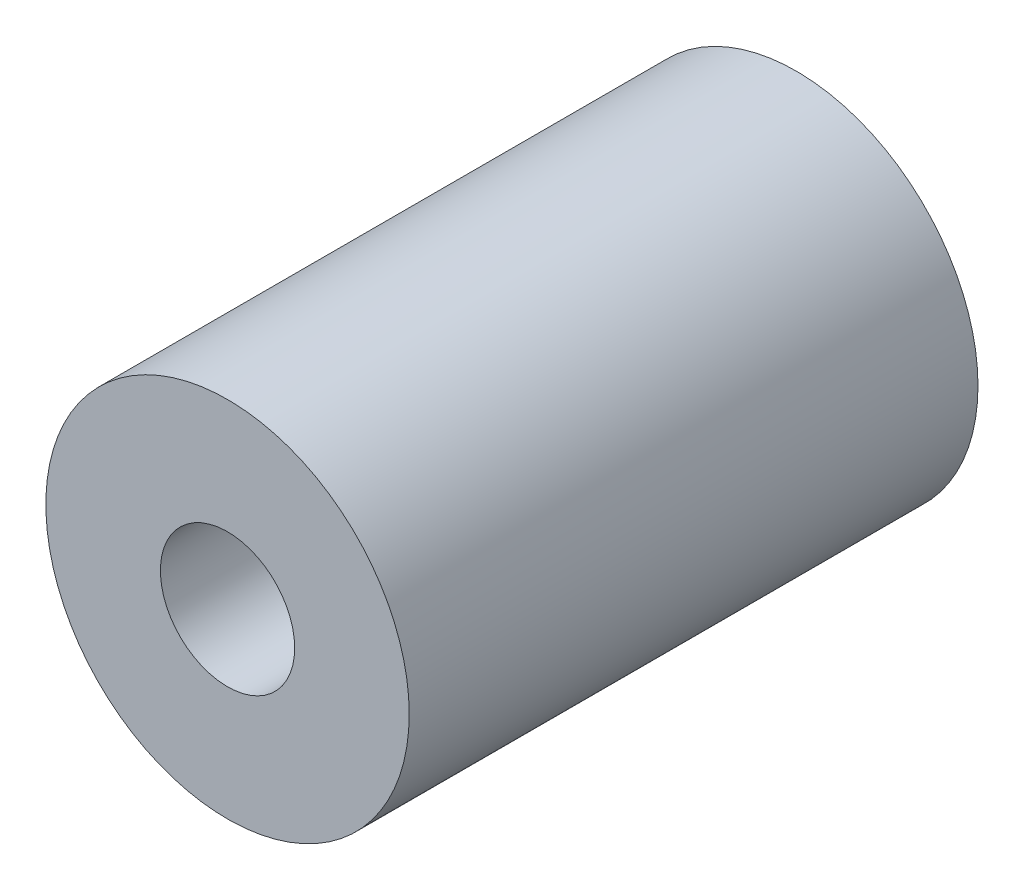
ISO-10303-21;
HEADER;
FILE_DESCRIPTION(('STEP AP214'),'2;1');
FILE_NAME('part.step','',(''),(''),'','','');
FILE_SCHEMA(('AUTOMOTIVE_DESIGN { 1 0 10303 214 1 1 1 1 }'));
ENDSEC;
DATA;
#1=APPLICATION_CONTEXT('core data for automotive mechanical design processes');
#2=APPLICATION_PROTOCOL_DEFINITION('international standard','automotive_design',2000,#1);
#3=PRODUCT_CONTEXT('',#1,'mechanical');
#4=PRODUCT('Part','Part','',(#3));
#5=PRODUCT_RELATED_PRODUCT_CATEGORY('part','',(#4));
#6=PRODUCT_DEFINITION_FORMATION('','',#4);
#7=PRODUCT_DEFINITION_CONTEXT('part definition',#1,'design');
#8=PRODUCT_DEFINITION('design','',#6,#7);
#9=PRODUCT_DEFINITION_SHAPE('','',#8);
#10=(LENGTH_UNIT() NAMED_UNIT(*) SI_UNIT(.MILLI.,.METRE.));
#11=(NAMED_UNIT(*) PLANE_ANGLE_UNIT() SI_UNIT($,.RADIAN.));
#12=(NAMED_UNIT(*) SI_UNIT($,.STERADIAN.) SOLID_ANGLE_UNIT());
#13=UNCERTAINTY_MEASURE_WITH_UNIT(LENGTH_MEASURE(1.E-05),#10,'distance_accuracy_value','');
#14=(GEOMETRIC_REPRESENTATION_CONTEXT(3) GLOBAL_UNCERTAINTY_ASSIGNED_CONTEXT((#13)) GLOBAL_UNIT_ASSIGNED_CONTEXT((#10,
#11,#12)) REPRESENTATION_CONTEXT('',''));
#15=CARTESIAN_POINT('',(0.,0.,0.));
#16=DIRECTION('',(0.,0.,1.));
#17=DIRECTION('',(1.,0.,0.));
#18=AXIS2_PLACEMENT_3D('',#15,#16,#17);
#19=CARTESIAN_POINT('',(0.,0.,7.2));
#20=DIRECTION('',(0.,0.,-1.));
#21=DIRECTION('',(-1.,0.,0.));
#22=AXIS2_PLACEMENT_3D('',#19,#20,#21);
#23=CYLINDRICAL_SURFACE('',#22,2.3);
#24=CARTESIAN_POINT('',(0.,0.,7.2));
#25=DIRECTION('',(0.,0.,1.));
#26=DIRECTION('',(1.,0.,0.));
#27=AXIS2_PLACEMENT_3D('',#24,#25,#26);
#28=CIRCLE('',#27,2.3);
#29=CARTESIAN_POINT('',(2.3,0.,7.2));
#30=VERTEX_POINT('',#29);
#31=EDGE_CURVE('E10',#30,#30,#28,.T.);
#32=ORIENTED_EDGE('',*,*,#31,.F.);
#33=EDGE_LOOP('',(#32));
#34=FACE_BOUND('',#33,.T.);
#35=CARTESIAN_POINT('',(0.,0.,0.));
#36=DIRECTION('',(0.,0.,1.));
#37=DIRECTION('',(1.,0.,0.));
#38=AXIS2_PLACEMENT_3D('',#35,#36,#37);
#39=CIRCLE('',#38,2.3);
#40=CARTESIAN_POINT('',(2.3,0.,0.));
#41=VERTEX_POINT('',#40);
#42=EDGE_CURVE('E17',#41,#41,#39,.T.);
#43=ORIENTED_EDGE('',*,*,#42,.T.);
#44=EDGE_LOOP('',(#43));
#45=FACE_BOUND('',#44,.T.);
#46=ADVANCED_FACE('F14',(#34,#45),#23,.T.);
#47=CARTESIAN_POINT('',(0.,0.,7.2));
#48=DIRECTION('',(0.,0.,1.));
#49=DIRECTION('',(1.,0.,0.));
#50=AXIS2_PLACEMENT_3D('',#47,#48,#49);
#51=PLANE('',#50);
#52=CARTESIAN_POINT('',(0.,0.,7.2));
#53=DIRECTION('',(0.,0.,1.));
#54=DIRECTION('',(1.,0.,0.));
#55=AXIS2_PLACEMENT_3D('',#52,#53,#54);
#56=CIRCLE('',#55,0.85);
#57=CARTESIAN_POINT('',(0.85,0.,7.2));
#58=VERTEX_POINT('',#57);
#59=EDGE_CURVE('E26',#58,#58,#56,.T.);
#60=ORIENTED_EDGE('',*,*,#59,.F.);
#61=EDGE_LOOP('',(#60));
#62=FACE_BOUND('',#61,.T.);
#63=ORIENTED_EDGE('',*,*,#31,.T.);
#64=EDGE_LOOP('',(#63));
#65=FACE_BOUND('',#64,.T.);
#66=ADVANCED_FACE('F41',(#62,#65),#51,.T.);
#67=CARTESIAN_POINT('',(0.,0.,0.));
#68=DIRECTION('',(0.,0.,1.));
#69=DIRECTION('',(1.,0.,0.));
#70=AXIS2_PLACEMENT_3D('',#67,#68,#69);
#71=PLANE('',#70);
#72=ORIENTED_EDGE('',*,*,#42,.F.);
#73=EDGE_LOOP('',(#72));
#74=FACE_BOUND('',#73,.T.);
#75=ADVANCED_FACE('F37',(#74),#71,.F.);
#76=CARTESIAN_POINT('',(0.,0.,3.6));
#77=DIRECTION('',(0.,0.,1.));
#78=DIRECTION('',(1.,0.,0.));
#79=AXIS2_PLACEMENT_3D('',#76,#77,#78);
#80=CYLINDRICAL_SURFACE('',#79,0.85);
#81=CARTESIAN_POINT('',(0.,0.,3.6));
#82=DIRECTION('',(0.,0.,1.));
#83=DIRECTION('',(1.,0.,0.));
#84=AXIS2_PLACEMENT_3D('',#81,#82,#83);
#85=CIRCLE('',#84,0.85);
#86=CARTESIAN_POINT('',(0.85,0.,3.6));
#87=VERTEX_POINT('',#86);
#88=EDGE_CURVE('E24',#87,#87,#85,.T.);
#89=ORIENTED_EDGE('',*,*,#88,.F.);
#90=EDGE_LOOP('',(#89));
#91=FACE_BOUND('',#90,.T.);
#92=ORIENTED_EDGE('',*,*,#59,.T.);
#93=EDGE_LOOP('',(#92));
#94=FACE_BOUND('',#93,.T.);
#95=ADVANCED_FACE('F34',(#91,#94),#80,.F.);
#96=CARTESIAN_POINT('',(0.,0.,3.6));
#97=DIRECTION('',(0.,0.,1.));
#98=DIRECTION('',(1.,0.,0.));
#99=AXIS2_PLACEMENT_3D('',#96,#97,#98);
#100=PLANE('',#99);
#101=ORIENTED_EDGE('',*,*,#88,.T.);
#102=EDGE_LOOP('',(#101));
#103=FACE_BOUND('',#102,.T.);
#104=ADVANCED_FACE('F32',(#103),#100,.T.);
#105=CLOSED_SHELL('',(#46,#66,#75,#95,#104));
#106=MANIFOLD_SOLID_BREP('B1',#105);
#107=ADVANCED_BREP_SHAPE_REPRESENTATION('',(#18,#106),#14);
#108=SHAPE_DEFINITION_REPRESENTATION(#9,#107);
ENDSEC;
END-ISO-10303-21;
